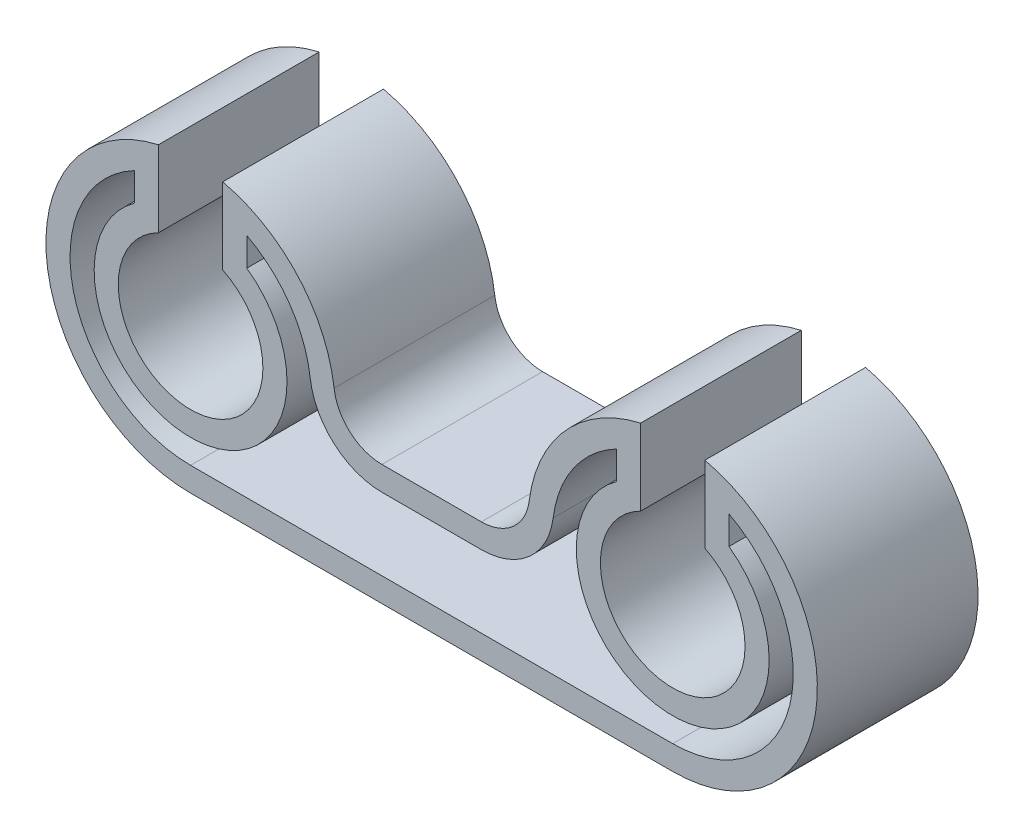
ISO-10303-21;
HEADER;
FILE_DESCRIPTION(('STEP AP214'),'2;1');
FILE_NAME('part.step','',(''),(''),'','','');
FILE_SCHEMA(('AUTOMOTIVE_DESIGN { 1 0 10303 214 1 1 1 1 }'));
ENDSEC;
DATA;
#1=APPLICATION_CONTEXT('core data for automotive mechanical design processes');
#2=APPLICATION_PROTOCOL_DEFINITION('international standard','automotive_design',2000,#1);
#3=PRODUCT_CONTEXT('',#1,'mechanical');
#4=PRODUCT('Part','Part','',(#3));
#5=PRODUCT_RELATED_PRODUCT_CATEGORY('part','',(#4));
#6=PRODUCT_DEFINITION_FORMATION('','',#4);
#7=PRODUCT_DEFINITION_CONTEXT('part definition',#1,'design');
#8=PRODUCT_DEFINITION('design','',#6,#7);
#9=PRODUCT_DEFINITION_SHAPE('','',#8);
#10=(LENGTH_UNIT() NAMED_UNIT(*) SI_UNIT(.MILLI.,.METRE.));
#11=(NAMED_UNIT(*) PLANE_ANGLE_UNIT() SI_UNIT($,.RADIAN.));
#12=(NAMED_UNIT(*) SI_UNIT($,.STERADIAN.) SOLID_ANGLE_UNIT());
#13=UNCERTAINTY_MEASURE_WITH_UNIT(LENGTH_MEASURE(1.E-05),#10,'distance_accuracy_value','');
#14=(GEOMETRIC_REPRESENTATION_CONTEXT(3) GLOBAL_UNCERTAINTY_ASSIGNED_CONTEXT((#13)) GLOBAL_UNIT_ASSIGNED_CONTEXT((#10,
#11,#12)) REPRESENTATION_CONTEXT('',''));
#15=CARTESIAN_POINT('',(0.,0.,0.));
#16=DIRECTION('',(0.,0.,1.));
#17=DIRECTION('',(1.,0.,0.));
#18=AXIS2_PLACEMENT_3D('',#15,#16,#17);
#19=CARTESIAN_POINT('',(30.,0.,10.));
#20=DIRECTION('',(0.,0.,1.));
#21=DIRECTION('',(1.,0.,0.));
#22=AXIS2_PLACEMENT_3D('',#19,#20,#21);
#23=PLANE('',#22);
#24=CARTESIAN_POINT('',(30.,0.,10.));
#25=DIRECTION('',(0.,0.,1.));
#26=DIRECTION('',(1.,0.,0.));
#27=AXIS2_PLACEMENT_3D('',#24,#25,#26);
#28=CIRCLE('',#27,18.);
#29=CARTESIAN_POINT('',(26.,17.5499287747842,10.));
#30=VERTEX_POINT('',#29);
#31=CARTESIAN_POINT('',(12.141178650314,2.25,10.));
#32=VERTEX_POINT('',#31);
#33=EDGE_CURVE('E410',#30,#32,#28,.T.);
#34=ORIENTED_EDGE('',*,*,#33,.T.);
#35=CARTESIAN_POINT('',(6.18823820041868,3.,10.));
#36=DIRECTION('',(0.,0.,-1.));
#37=DIRECTION('',(-1.,0.,0.));
#38=AXIS2_PLACEMENT_3D('',#35,#36,#37);
#39=CIRCLE('',#38,6.);
#40=CARTESIAN_POINT('',(6.18823820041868,-3.,10.));
#41=VERTEX_POINT('',#40);
#42=EDGE_CURVE('E413',#32,#41,#39,.T.);
#43=ORIENTED_EDGE('',*,*,#42,.T.);
#44=DIRECTION('',(-1.,0.,0.));
#45=VECTOR('',#44,1.);
#46=CARTESIAN_POINT('',(-6.18823820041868,-3.,10.));
#47=LINE('',#46,#45);
#48=CARTESIAN_POINT('',(-6.18823820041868,-3.,10.));
#49=VERTEX_POINT('',#48);
#50=EDGE_CURVE('E416',#41,#49,#47,.T.);
#51=ORIENTED_EDGE('',*,*,#50,.T.);
#52=CARTESIAN_POINT('',(-6.18823820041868,3.,10.));
#53=DIRECTION('',(0.,0.,-1.));
#54=DIRECTION('',(-1.,0.,0.));
#55=AXIS2_PLACEMENT_3D('',#52,#53,#54);
#56=CIRCLE('',#55,6.);
#57=CARTESIAN_POINT('',(-12.141178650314,2.25,10.));
#58=VERTEX_POINT('',#57);
#59=EDGE_CURVE('E418',#49,#58,#56,.T.);
#60=ORIENTED_EDGE('',*,*,#59,.T.);
#61=CARTESIAN_POINT('',(-30.,0.,10.));
#62=DIRECTION('',(0.,0.,1.));
#63=DIRECTION('',(1.,0.,0.));
#64=AXIS2_PLACEMENT_3D('',#61,#62,#63);
#65=CIRCLE('',#64,18.);
#66=CARTESIAN_POINT('',(-26.,17.5499287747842,10.));
#67=VERTEX_POINT('',#66);
#68=EDGE_CURVE('E420',#58,#67,#65,.T.);
#69=ORIENTED_EDGE('',*,*,#68,.T.);
#70=DIRECTION('',(0.,-1.,0.));
#71=VECTOR('',#70,1.);
#72=CARTESIAN_POINT('',(-26.,17.5499287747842,10.));
#73=LINE('',#72,#71);
#74=CARTESIAN_POINT('',(-26.,8.06225774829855,10.));
#75=VERTEX_POINT('',#74);
#76=EDGE_CURVE('E422',#67,#75,#73,.T.);
#77=ORIENTED_EDGE('',*,*,#76,.T.);
#78=CARTESIAN_POINT('',(-30.,0.,10.));
#79=DIRECTION('',(0.,0.,-1.));
#80=DIRECTION('',(1.,0.,0.));
#81=AXIS2_PLACEMENT_3D('',#78,#79,#80);
#82=CIRCLE('',#81,9.);
#83=CARTESIAN_POINT('',(-34.,8.06225774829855,10.));
#84=VERTEX_POINT('',#83);
#85=EDGE_CURVE('E424',#75,#84,#82,.T.);
#86=ORIENTED_EDGE('',*,*,#85,.T.);
#87=DIRECTION('',(0.,1.,0.));
#88=VECTOR('',#87,1.);
#89=CARTESIAN_POINT('',(-34.,17.5499287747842,10.));
#90=LINE('',#89,#88);
#91=CARTESIAN_POINT('',(-34.,17.5499287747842,10.));
#92=VERTEX_POINT('',#91);
#93=EDGE_CURVE('E426',#84,#92,#90,.T.);
#94=ORIENTED_EDGE('',*,*,#93,.T.);
#95=CARTESIAN_POINT('',(-30.,0.,10.));
#96=DIRECTION('',(0.,0.,1.));
#97=DIRECTION('',(1.,0.,0.));
#98=AXIS2_PLACEMENT_3D('',#95,#96,#97);
#99=CIRCLE('',#98,18.);
#100=CARTESIAN_POINT('',(-30.,-18.,10.));
#101=VERTEX_POINT('',#100);
#102=EDGE_CURVE('E428',#92,#101,#99,.T.);
#103=ORIENTED_EDGE('',*,*,#102,.T.);
#104=DIRECTION('',(1.,0.,0.));
#105=VECTOR('',#104,1.);
#106=CARTESIAN_POINT('',(-30.,-18.,10.));
#107=LINE('',#106,#105);
#108=CARTESIAN_POINT('',(30.,-18.,10.));
#109=VERTEX_POINT('',#108);
#110=EDGE_CURVE('E430',#101,#109,#107,.T.);
#111=ORIENTED_EDGE('',*,*,#110,.T.);
#112=CARTESIAN_POINT('',(30.,0.,10.));
#113=DIRECTION('',(0.,0.,1.));
#114=DIRECTION('',(1.,0.,0.));
#115=AXIS2_PLACEMENT_3D('',#112,#113,#114);
#116=CIRCLE('',#115,18.);
#117=CARTESIAN_POINT('',(34.,17.5499287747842,10.));
#118=VERTEX_POINT('',#117);
#119=EDGE_CURVE('E432',#109,#118,#116,.T.);
#120=ORIENTED_EDGE('',*,*,#119,.T.);
#121=DIRECTION('',(0.,-1.,0.));
#122=VECTOR('',#121,1.);
#123=CARTESIAN_POINT('',(34.,17.5499287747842,10.));
#124=LINE('',#123,#122);
#125=CARTESIAN_POINT('',(34.,8.06225774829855,10.));
#126=VERTEX_POINT('',#125);
#127=EDGE_CURVE('E434',#118,#126,#124,.T.);
#128=ORIENTED_EDGE('',*,*,#127,.T.);
#129=CARTESIAN_POINT('',(30.,0.,10.));
#130=DIRECTION('',(0.,0.,-1.));
#131=DIRECTION('',(1.,0.,0.));
#132=AXIS2_PLACEMENT_3D('',#129,#130,#131);
#133=CIRCLE('',#132,9.);
#134=CARTESIAN_POINT('',(26.,8.06225774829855,10.));
#135=VERTEX_POINT('',#134);
#136=EDGE_CURVE('E436',#126,#135,#133,.T.);
#137=ORIENTED_EDGE('',*,*,#136,.T.);
#138=DIRECTION('',(0.,1.,0.));
#139=VECTOR('',#138,1.);
#140=CARTESIAN_POINT('',(26.,17.5499287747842,10.));
#141=LINE('',#140,#139);
#142=EDGE_CURVE('E438',#135,#30,#141,.T.);
#143=ORIENTED_EDGE('',*,*,#142,.T.);
#144=EDGE_LOOP('',(#34,#43,#51,#60,#69,#77,#86,#94,#103,#111,#120,#128,#137,#143));
#145=FACE_BOUND('',#144,.T.);
#146=CARTESIAN_POINT('',(6.18823820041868,3.,10.));
#147=DIRECTION('',(0.,0.,1.));
#148=DIRECTION('',(1.,0.,0.));
#149=AXIS2_PLACEMENT_3D('',#146,#147,#148);
#150=CIRCLE('',#149,9.);
#151=CARTESIAN_POINT('',(15.1176488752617,1.87500000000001,10.));
#152=VERTEX_POINT('',#151);
#153=CARTESIAN_POINT('',(6.18823820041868,-6.,10.));
#154=VERTEX_POINT('',#153);
#155=EDGE_CURVE('E311',#152,#154,#150,.F.);
#156=ORIENTED_EDGE('',*,*,#155,.F.);
#157=CARTESIAN_POINT('',(30.,0.,10.));
#158=DIRECTION('',(0.,0.,1.));
#159=DIRECTION('',(1.,0.,0.));
#160=AXIS2_PLACEMENT_3D('',#157,#158,#159);
#161=CIRCLE('',#160,15.);
#162=CARTESIAN_POINT('',(23.,13.2664991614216,10.));
#163=VERTEX_POINT('',#162);
#164=EDGE_CURVE('E303',#163,#152,#161,.T.);
#165=ORIENTED_EDGE('',*,*,#164,.F.);
#166=DIRECTION('',(0.,1.,0.));
#167=VECTOR('',#166,1.);
#168=CARTESIAN_POINT('',(23.,17.5499287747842,10.));
#169=LINE('',#168,#167);
#170=CARTESIAN_POINT('',(23.,9.74679434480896,10.));
#171=VERTEX_POINT('',#170);
#172=EDGE_CURVE('E348',#171,#163,#169,.T.);
#173=ORIENTED_EDGE('',*,*,#172,.F.);
#174=CARTESIAN_POINT('',(30.,0.,10.));
#175=DIRECTION('',(0.,0.,1.));
#176=DIRECTION('',(1.,0.,0.));
#177=AXIS2_PLACEMENT_3D('',#174,#175,#176);
#178=CIRCLE('',#177,12.);
#179=CARTESIAN_POINT('',(37.,9.74679434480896,10.));
#180=VERTEX_POINT('',#179);
#181=EDGE_CURVE('E346',#180,#171,#178,.F.);
#182=ORIENTED_EDGE('',*,*,#181,.F.);
#183=DIRECTION('',(0.,-1.,0.));
#184=VECTOR('',#183,1.);
#185=CARTESIAN_POINT('',(37.,17.5499287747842,10.));
#186=LINE('',#185,#184);
#187=CARTESIAN_POINT('',(37.,13.2664991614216,10.));
#188=VERTEX_POINT('',#187);
#189=EDGE_CURVE('E344',#188,#180,#186,.T.);
#190=ORIENTED_EDGE('',*,*,#189,.F.);
#191=CARTESIAN_POINT('',(30.,0.,10.));
#192=DIRECTION('',(0.,0.,1.));
#193=DIRECTION('',(1.,0.,0.));
#194=AXIS2_PLACEMENT_3D('',#191,#192,#193);
#195=CIRCLE('',#194,15.);
#196=CARTESIAN_POINT('',(30.,-15.,10.));
#197=VERTEX_POINT('',#196);
#198=EDGE_CURVE('E342',#197,#188,#195,.T.);
#199=ORIENTED_EDGE('',*,*,#198,.F.);
#200=DIRECTION('',(1.,0.,0.));
#201=VECTOR('',#200,1.);
#202=CARTESIAN_POINT('',(-30.,-15.,10.));
#203=LINE('',#202,#201);
#204=CARTESIAN_POINT('',(-30.,-15.,10.));
#205=VERTEX_POINT('',#204);
#206=EDGE_CURVE('E340',#205,#197,#203,.T.);
#207=ORIENTED_EDGE('',*,*,#206,.F.);
#208=CARTESIAN_POINT('',(-30.,0.,10.));
#209=DIRECTION('',(0.,0.,1.));
#210=DIRECTION('',(1.,0.,0.));
#211=AXIS2_PLACEMENT_3D('',#208,#209,#210);
#212=CIRCLE('',#211,15.);
#213=CARTESIAN_POINT('',(-37.,13.2664991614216,10.));
#214=VERTEX_POINT('',#213);
#215=EDGE_CURVE('E338',#214,#205,#212,.T.);
#216=ORIENTED_EDGE('',*,*,#215,.F.);
#217=DIRECTION('',(0.,1.,0.));
#218=VECTOR('',#217,1.);
#219=CARTESIAN_POINT('',(-37.,17.5499287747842,10.));
#220=LINE('',#219,#218);
#221=CARTESIAN_POINT('',(-37.,9.74679434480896,10.));
#222=VERTEX_POINT('',#221);
#223=EDGE_CURVE('E336',#222,#214,#220,.T.);
#224=ORIENTED_EDGE('',*,*,#223,.F.);
#225=CARTESIAN_POINT('',(-30.,0.,10.));
#226=DIRECTION('',(0.,0.,1.));
#227=DIRECTION('',(1.,0.,0.));
#228=AXIS2_PLACEMENT_3D('',#225,#226,#227);
#229=CIRCLE('',#228,12.);
#230=CARTESIAN_POINT('',(-23.,9.74679434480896,10.));
#231=VERTEX_POINT('',#230);
#232=EDGE_CURVE('E334',#231,#222,#229,.F.);
#233=ORIENTED_EDGE('',*,*,#232,.F.);
#234=DIRECTION('',(0.,-1.,0.));
#235=VECTOR('',#234,1.);
#236=CARTESIAN_POINT('',(-23.,17.5499287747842,10.));
#237=LINE('',#236,#235);
#238=CARTESIAN_POINT('',(-23.,13.2664991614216,10.));
#239=VERTEX_POINT('',#238);
#240=EDGE_CURVE('E332',#239,#231,#237,.T.);
#241=ORIENTED_EDGE('',*,*,#240,.F.);
#242=CARTESIAN_POINT('',(-30.,0.,10.));
#243=DIRECTION('',(0.,0.,1.));
#244=DIRECTION('',(1.,0.,0.));
#245=AXIS2_PLACEMENT_3D('',#242,#243,#244);
#246=CIRCLE('',#245,15.);
#247=CARTESIAN_POINT('',(-15.1176488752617,1.875,10.));
#248=VERTEX_POINT('',#247);
#249=EDGE_CURVE('E330',#248,#239,#246,.T.);
#250=ORIENTED_EDGE('',*,*,#249,.F.);
#251=CARTESIAN_POINT('',(-6.18823820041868,3.,10.));
#252=DIRECTION('',(0.,0.,1.));
#253=DIRECTION('',(1.,0.,0.));
#254=AXIS2_PLACEMENT_3D('',#251,#252,#253);
#255=CIRCLE('',#254,9.);
#256=CARTESIAN_POINT('',(-6.18823820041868,-6.,10.));
#257=VERTEX_POINT('',#256);
#258=EDGE_CURVE('E326',#257,#248,#255,.F.);
#259=ORIENTED_EDGE('',*,*,#258,.F.);
#260=DIRECTION('',(-1.,0.,0.));
#261=VECTOR('',#260,1.);
#262=CARTESIAN_POINT('',(-6.18823820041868,-6.,10.));
#263=LINE('',#262,#261);
#264=EDGE_CURVE('E324',#154,#257,#263,.T.);
#265=ORIENTED_EDGE('',*,*,#264,.F.);
#266=EDGE_LOOP('',(#156,#165,#173,#182,#190,#199,#207,#216,#224,#233,#241,#250,#259,#265));
#267=FACE_BOUND('',#266,.T.);
#268=ADVANCED_FACE('F118',(#145,#267),#23,.T.);
#269=CARTESIAN_POINT('',(30.,0.,-10.));
#270=DIRECTION('',(0.,0.,1.));
#271=DIRECTION('',(1.,0.,0.));
#272=AXIS2_PLACEMENT_3D('',#269,#270,#271);
#273=PLANE('',#272);
#274=CARTESIAN_POINT('',(30.,0.,-10.));
#275=DIRECTION('',(0.,0.,1.));
#276=DIRECTION('',(1.,0.,0.));
#277=AXIS2_PLACEMENT_3D('',#274,#275,#276);
#278=CIRCLE('',#277,18.);
#279=CARTESIAN_POINT('',(26.,17.5499287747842,-10.));
#280=VERTEX_POINT('',#279);
#281=CARTESIAN_POINT('',(12.141178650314,2.25,-10.));
#282=VERTEX_POINT('',#281);
#283=EDGE_CURVE('E319',#280,#282,#278,.T.);
#284=ORIENTED_EDGE('',*,*,#283,.F.);
#285=DIRECTION('',(0.,1.,0.));
#286=VECTOR('',#285,1.);
#287=CARTESIAN_POINT('',(26.,17.5499287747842,-10.));
#288=LINE('',#287,#286);
#289=CARTESIAN_POINT('',(26.,8.06225774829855,-10.));
#290=VERTEX_POINT('',#289);
#291=EDGE_CURVE('E414',#290,#280,#288,.T.);
#292=ORIENTED_EDGE('',*,*,#291,.F.);
#293=CARTESIAN_POINT('',(30.,0.,-10.));
#294=DIRECTION('',(0.,0.,-1.));
#295=DIRECTION('',(1.,0.,0.));
#296=AXIS2_PLACEMENT_3D('',#293,#294,#295);
#297=CIRCLE('',#296,9.);
#298=CARTESIAN_POINT('',(34.,8.06225774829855,-10.));
#299=VERTEX_POINT('',#298);
#300=EDGE_CURVE('E465',#299,#290,#297,.T.);
#301=ORIENTED_EDGE('',*,*,#300,.F.);
#302=DIRECTION('',(0.,-1.,0.));
#303=VECTOR('',#302,1.);
#304=CARTESIAN_POINT('',(34.,17.5499287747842,-10.));
#305=LINE('',#304,#303);
#306=CARTESIAN_POINT('',(34.,17.5499287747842,-10.));
#307=VERTEX_POINT('',#306);
#308=EDGE_CURVE('E463',#307,#299,#305,.T.);
#309=ORIENTED_EDGE('',*,*,#308,.F.);
#310=CARTESIAN_POINT('',(30.,0.,-10.));
#311=DIRECTION('',(0.,0.,1.));
#312=DIRECTION('',(1.,0.,0.));
#313=AXIS2_PLACEMENT_3D('',#310,#311,#312);
#314=CIRCLE('',#313,18.);
#315=CARTESIAN_POINT('',(30.,-18.,-10.));
#316=VERTEX_POINT('',#315);
#317=EDGE_CURVE('E461',#316,#307,#314,.T.);
#318=ORIENTED_EDGE('',*,*,#317,.F.);
#319=DIRECTION('',(1.,0.,0.));
#320=VECTOR('',#319,1.);
#321=CARTESIAN_POINT('',(-30.,-18.,-10.));
#322=LINE('',#321,#320);
#323=CARTESIAN_POINT('',(-30.,-18.,-10.));
#324=VERTEX_POINT('',#323);
#325=EDGE_CURVE('E459',#324,#316,#322,.T.);
#326=ORIENTED_EDGE('',*,*,#325,.F.);
#327=CARTESIAN_POINT('',(-30.,0.,-10.));
#328=DIRECTION('',(0.,0.,1.));
#329=DIRECTION('',(1.,0.,0.));
#330=AXIS2_PLACEMENT_3D('',#327,#328,#329);
#331=CIRCLE('',#330,18.);
#332=CARTESIAN_POINT('',(-34.,17.5499287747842,-10.));
#333=VERTEX_POINT('',#332);
#334=EDGE_CURVE('E457',#333,#324,#331,.T.);
#335=ORIENTED_EDGE('',*,*,#334,.F.);
#336=DIRECTION('',(0.,1.,0.));
#337=VECTOR('',#336,1.);
#338=CARTESIAN_POINT('',(-34.,17.5499287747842,-10.));
#339=LINE('',#338,#337);
#340=CARTESIAN_POINT('',(-34.,8.06225774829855,-10.));
#341=VERTEX_POINT('',#340);
#342=EDGE_CURVE('E455',#341,#333,#339,.T.);
#343=ORIENTED_EDGE('',*,*,#342,.F.);
#344=CARTESIAN_POINT('',(-30.,0.,-10.));
#345=DIRECTION('',(0.,0.,-1.));
#346=DIRECTION('',(1.,0.,0.));
#347=AXIS2_PLACEMENT_3D('',#344,#345,#346);
#348=CIRCLE('',#347,9.);
#349=CARTESIAN_POINT('',(-26.,8.06225774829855,-10.));
#350=VERTEX_POINT('',#349);
#351=EDGE_CURVE('E453',#350,#341,#348,.T.);
#352=ORIENTED_EDGE('',*,*,#351,.F.);
#353=DIRECTION('',(0.,-1.,0.));
#354=VECTOR('',#353,1.);
#355=CARTESIAN_POINT('',(-26.,17.5499287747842,-10.));
#356=LINE('',#355,#354);
#357=CARTESIAN_POINT('',(-26.,17.5499287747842,-10.));
#358=VERTEX_POINT('',#357);
#359=EDGE_CURVE('E451',#358,#350,#356,.T.);
#360=ORIENTED_EDGE('',*,*,#359,.F.);
#361=CARTESIAN_POINT('',(-30.,0.,-10.));
#362=DIRECTION('',(0.,0.,1.));
#363=DIRECTION('',(1.,0.,0.));
#364=AXIS2_PLACEMENT_3D('',#361,#362,#363);
#365=CIRCLE('',#364,18.);
#366=CARTESIAN_POINT('',(-12.141178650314,2.25,-10.));
#367=VERTEX_POINT('',#366);
#368=EDGE_CURVE('E449',#367,#358,#365,.T.);
#369=ORIENTED_EDGE('',*,*,#368,.F.);
#370=CARTESIAN_POINT('',(-6.18823820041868,3.,-10.));
#371=DIRECTION('',(0.,0.,-1.));
#372=DIRECTION('',(-1.,0.,0.));
#373=AXIS2_PLACEMENT_3D('',#370,#371,#372);
#374=CIRCLE('',#373,6.);
#375=CARTESIAN_POINT('',(-6.18823820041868,-3.,-10.));
#376=VERTEX_POINT('',#375);
#377=EDGE_CURVE('E447',#376,#367,#374,.T.);
#378=ORIENTED_EDGE('',*,*,#377,.F.);
#379=DIRECTION('',(-1.,0.,0.));
#380=VECTOR('',#379,1.);
#381=CARTESIAN_POINT('',(-6.18823820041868,-3.,-10.));
#382=LINE('',#381,#380);
#383=CARTESIAN_POINT('',(6.18823820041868,-3.,-10.));
#384=VERTEX_POINT('',#383);
#385=EDGE_CURVE('E445',#384,#376,#382,.T.);
#386=ORIENTED_EDGE('',*,*,#385,.F.);
#387=CARTESIAN_POINT('',(6.18823820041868,3.,-10.));
#388=DIRECTION('',(0.,0.,-1.));
#389=DIRECTION('',(-1.,0.,0.));
#390=AXIS2_PLACEMENT_3D('',#387,#388,#389);
#391=CIRCLE('',#390,6.);
#392=EDGE_CURVE('E443',#282,#384,#391,.T.);
#393=ORIENTED_EDGE('',*,*,#392,.F.);
#394=EDGE_LOOP('',(#284,#292,#301,#309,#318,#326,#335,#343,#352,#360,#369,#378,#386,#393));
#395=FACE_BOUND('',#394,.T.);
#396=CARTESIAN_POINT('',(30.,0.,-10.));
#397=DIRECTION('',(0.,0.,1.));
#398=DIRECTION('',(1.,0.,0.));
#399=AXIS2_PLACEMENT_3D('',#396,#397,#398);
#400=CIRCLE('',#399,15.);
#401=CARTESIAN_POINT('',(23.,13.2664991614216,-10.));
#402=VERTEX_POINT('',#401);
#403=CARTESIAN_POINT('',(15.1176488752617,1.87500000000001,-10.));
#404=VERTEX_POINT('',#403);
#405=EDGE_CURVE('E141',#402,#404,#400,.T.);
#406=ORIENTED_EDGE('',*,*,#405,.T.);
#407=CARTESIAN_POINT('',(6.18823820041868,3.,-10.));
#408=DIRECTION('',(0.,0.,1.));
#409=DIRECTION('',(1.,0.,0.));
#410=AXIS2_PLACEMENT_3D('',#407,#408,#409);
#411=CIRCLE('',#410,9.);
#412=CARTESIAN_POINT('',(6.18823820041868,-6.,-10.));
#413=VERTEX_POINT('',#412);
#414=EDGE_CURVE('E318',#404,#413,#411,.F.);
#415=ORIENTED_EDGE('',*,*,#414,.T.);
#416=DIRECTION('',(-1.,0.,0.));
#417=VECTOR('',#416,1.);
#418=CARTESIAN_POINT('',(-6.18823820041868,-6.,-10.));
#419=LINE('',#418,#417);
#420=CARTESIAN_POINT('',(-6.18823820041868,-6.,-10.));
#421=VERTEX_POINT('',#420);
#422=EDGE_CURVE('E352',#413,#421,#419,.T.);
#423=ORIENTED_EDGE('',*,*,#422,.T.);
#424=CARTESIAN_POINT('',(-6.18823820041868,3.,-10.));
#425=DIRECTION('',(0.,0.,1.));
#426=DIRECTION('',(1.,0.,0.));
#427=AXIS2_PLACEMENT_3D('',#424,#425,#426);
#428=CIRCLE('',#427,9.);
#429=CARTESIAN_POINT('',(-15.1176488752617,1.875,-10.));
#430=VERTEX_POINT('',#429);
#431=EDGE_CURVE('E355',#421,#430,#428,.F.);
#432=ORIENTED_EDGE('',*,*,#431,.T.);
#433=CARTESIAN_POINT('',(-30.,0.,-10.));
#434=DIRECTION('',(0.,0.,1.));
#435=DIRECTION('',(1.,0.,0.));
#436=AXIS2_PLACEMENT_3D('',#433,#434,#435);
#437=CIRCLE('',#436,15.);
#438=CARTESIAN_POINT('',(-23.,13.2664991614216,-10.));
#439=VERTEX_POINT('',#438);
#440=EDGE_CURVE('E358',#430,#439,#437,.T.);
#441=ORIENTED_EDGE('',*,*,#440,.T.);
#442=DIRECTION('',(0.,-1.,0.));
#443=VECTOR('',#442,1.);
#444=CARTESIAN_POINT('',(-23.,17.5499287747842,-10.));
#445=LINE('',#444,#443);
#446=CARTESIAN_POINT('',(-23.,9.74679434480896,-10.));
#447=VERTEX_POINT('',#446);
#448=EDGE_CURVE('E361',#439,#447,#445,.T.);
#449=ORIENTED_EDGE('',*,*,#448,.T.);
#450=CARTESIAN_POINT('',(-30.,0.,-10.));
#451=DIRECTION('',(0.,0.,1.));
#452=DIRECTION('',(1.,0.,0.));
#453=AXIS2_PLACEMENT_3D('',#450,#451,#452);
#454=CIRCLE('',#453,12.);
#455=CARTESIAN_POINT('',(-37.,9.74679434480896,-10.));
#456=VERTEX_POINT('',#455);
#457=EDGE_CURVE('E364',#447,#456,#454,.F.);
#458=ORIENTED_EDGE('',*,*,#457,.T.);
#459=DIRECTION('',(0.,1.,0.));
#460=VECTOR('',#459,1.);
#461=CARTESIAN_POINT('',(-37.,17.5499287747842,-10.));
#462=LINE('',#461,#460);
#463=CARTESIAN_POINT('',(-37.,13.2664991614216,-10.));
#464=VERTEX_POINT('',#463);
#465=EDGE_CURVE('E367',#456,#464,#462,.T.);
#466=ORIENTED_EDGE('',*,*,#465,.T.);
#467=CARTESIAN_POINT('',(-30.,0.,-10.));
#468=DIRECTION('',(0.,0.,1.));
#469=DIRECTION('',(1.,0.,0.));
#470=AXIS2_PLACEMENT_3D('',#467,#468,#469);
#471=CIRCLE('',#470,15.);
#472=CARTESIAN_POINT('',(-30.,-15.,-10.));
#473=VERTEX_POINT('',#472);
#474=EDGE_CURVE('E370',#464,#473,#471,.T.);
#475=ORIENTED_EDGE('',*,*,#474,.T.);
#476=DIRECTION('',(1.,0.,0.));
#477=VECTOR('',#476,1.);
#478=CARTESIAN_POINT('',(-30.,-15.,-10.));
#479=LINE('',#478,#477);
#480=CARTESIAN_POINT('',(30.,-15.,-10.));
#481=VERTEX_POINT('',#480);
#482=EDGE_CURVE('E373',#473,#481,#479,.T.);
#483=ORIENTED_EDGE('',*,*,#482,.T.);
#484=CARTESIAN_POINT('',(30.,0.,-10.));
#485=DIRECTION('',(0.,0.,1.));
#486=DIRECTION('',(1.,0.,0.));
#487=AXIS2_PLACEMENT_3D('',#484,#485,#486);
#488=CIRCLE('',#487,15.);
#489=CARTESIAN_POINT('',(37.,13.2664991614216,-10.));
#490=VERTEX_POINT('',#489);
#491=EDGE_CURVE('E376',#481,#490,#488,.T.);
#492=ORIENTED_EDGE('',*,*,#491,.T.);
#493=DIRECTION('',(0.,-1.,0.));
#494=VECTOR('',#493,1.);
#495=CARTESIAN_POINT('',(37.,17.5499287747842,-10.));
#496=LINE('',#495,#494);
#497=CARTESIAN_POINT('',(37.,9.74679434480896,-10.));
#498=VERTEX_POINT('',#497);
#499=EDGE_CURVE('E379',#490,#498,#496,.T.);
#500=ORIENTED_EDGE('',*,*,#499,.T.);
#501=CARTESIAN_POINT('',(30.,0.,-10.));
#502=DIRECTION('',(0.,0.,1.));
#503=DIRECTION('',(1.,0.,0.));
#504=AXIS2_PLACEMENT_3D('',#501,#502,#503);
#505=CIRCLE('',#504,12.);
#506=CARTESIAN_POINT('',(23.,9.74679434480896,-10.));
#507=VERTEX_POINT('',#506);
#508=EDGE_CURVE('E382',#498,#507,#505,.F.);
#509=ORIENTED_EDGE('',*,*,#508,.T.);
#510=DIRECTION('',(0.,1.,0.));
#511=VECTOR('',#510,1.);
#512=CARTESIAN_POINT('',(23.,17.5499287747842,-10.));
#513=LINE('',#512,#511);
#514=EDGE_CURVE('E312',#507,#402,#513,.T.);
#515=ORIENTED_EDGE('',*,*,#514,.T.);
#516=EDGE_LOOP('',(#406,#415,#423,#432,#441,#449,#458,#466,#475,#483,#492,#500,#509,#515));
#517=FACE_BOUND('',#516,.T.);
#518=ADVANCED_FACE('F513',(#395,#517),#273,.F.);
#519=CARTESIAN_POINT('',(30.,0.,10.));
#520=DIRECTION('',(0.,0.,-1.));
#521=DIRECTION('',(-1.,0.,0.));
#522=AXIS2_PLACEMENT_3D('',#519,#520,#521);
#523=CYLINDRICAL_SURFACE('',#522,18.);
#524=ORIENTED_EDGE('',*,*,#283,.T.);
#525=DIRECTION('',(0.,0.,-1.));
#526=VECTOR('',#525,1.);
#527=CARTESIAN_POINT('',(12.141178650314,2.25,10.));
#528=LINE('',#527,#526);
#529=EDGE_CURVE('E12',#32,#282,#528,.T.);
#530=ORIENTED_EDGE('',*,*,#529,.F.);
#531=ORIENTED_EDGE('',*,*,#33,.F.);
#532=DIRECTION('',(0.,0.,-1.));
#533=VECTOR('',#532,1.);
#534=CARTESIAN_POINT('',(26.,17.5499287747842,10.));
#535=LINE('',#534,#533);
#536=EDGE_CURVE('E440',#30,#280,#535,.T.);
#537=ORIENTED_EDGE('',*,*,#536,.T.);
#538=EDGE_LOOP('',(#524,#530,#531,#537));
#539=FACE_BOUND('',#538,.T.);
#540=ADVANCED_FACE('F120',(#539),#523,.T.);
#541=CARTESIAN_POINT('',(6.18823820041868,3.,10.));
#542=DIRECTION('',(0.,0.,-1.));
#543=DIRECTION('',(-1.,0.,0.));
#544=AXIS2_PLACEMENT_3D('',#541,#542,#543);
#545=CYLINDRICAL_SURFACE('',#544,6.);
#546=ORIENTED_EDGE('',*,*,#392,.T.);
#547=DIRECTION('',(0.,0.,-1.));
#548=VECTOR('',#547,1.);
#549=CARTESIAN_POINT('',(6.18823820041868,-3.,10.));
#550=LINE('',#549,#548);
#551=EDGE_CURVE('E126',#41,#384,#550,.T.);
#552=ORIENTED_EDGE('',*,*,#551,.F.);
#553=ORIENTED_EDGE('',*,*,#42,.F.);
#554=ORIENTED_EDGE('',*,*,#529,.T.);
#555=EDGE_LOOP('',(#546,#552,#553,#554));
#556=FACE_BOUND('',#555,.T.);
#557=ADVANCED_FACE('F530',(#556),#545,.F.);
#558=CARTESIAN_POINT('',(-6.18823820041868,-3.,10.));
#559=DIRECTION('',(0.,-1.,0.));
#560=DIRECTION('',(0.,0.,-1.));
#561=AXIS2_PLACEMENT_3D('',#558,#559,#560);
#562=PLANE('',#561);
#563=ORIENTED_EDGE('',*,*,#385,.T.);
#564=DIRECTION('',(0.,0.,-1.));
#565=VECTOR('',#564,1.);
#566=CARTESIAN_POINT('',(-6.18823820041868,-3.,10.));
#567=LINE('',#566,#565);
#568=EDGE_CURVE('E500',#49,#376,#567,.T.);
#569=ORIENTED_EDGE('',*,*,#568,.F.);
#570=ORIENTED_EDGE('',*,*,#50,.F.);
#571=ORIENTED_EDGE('',*,*,#551,.T.);
#572=EDGE_LOOP('',(#563,#569,#570,#571));
#573=FACE_BOUND('',#572,.T.);
#574=ADVANCED_FACE('F507',(#573),#562,.F.);
#575=CARTESIAN_POINT('',(-6.18823820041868,3.,10.));
#576=DIRECTION('',(0.,0.,-1.));
#577=DIRECTION('',(-1.,0.,0.));
#578=AXIS2_PLACEMENT_3D('',#575,#576,#577);
#579=CYLINDRICAL_SURFACE('',#578,6.);
#580=ORIENTED_EDGE('',*,*,#377,.T.);
#581=DIRECTION('',(0.,0.,-1.));
#582=VECTOR('',#581,1.);
#583=CARTESIAN_POINT('',(-12.141178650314,2.25,10.));
#584=LINE('',#583,#582);
#585=EDGE_CURVE('E497',#58,#367,#584,.T.);
#586=ORIENTED_EDGE('',*,*,#585,.F.);
#587=ORIENTED_EDGE('',*,*,#59,.F.);
#588=ORIENTED_EDGE('',*,*,#568,.T.);
#589=EDGE_LOOP('',(#580,#586,#587,#588));
#590=FACE_BOUND('',#589,.T.);
#591=ADVANCED_FACE('F519',(#590),#579,.F.);
#592=CARTESIAN_POINT('',(-30.,0.,10.));
#593=DIRECTION('',(0.,0.,-1.));
#594=DIRECTION('',(-1.,0.,0.));
#595=AXIS2_PLACEMENT_3D('',#592,#593,#594);
#596=CYLINDRICAL_SURFACE('',#595,18.);
#597=ORIENTED_EDGE('',*,*,#368,.T.);
#598=DIRECTION('',(0.,0.,-1.));
#599=VECTOR('',#598,1.);
#600=CARTESIAN_POINT('',(-26.,17.5499287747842,10.));
#601=LINE('',#600,#599);
#602=EDGE_CURVE('E494',#67,#358,#601,.T.);
#603=ORIENTED_EDGE('',*,*,#602,.F.);
#604=ORIENTED_EDGE('',*,*,#68,.F.);
#605=ORIENTED_EDGE('',*,*,#585,.T.);
#606=EDGE_LOOP('',(#597,#603,#604,#605));
#607=FACE_BOUND('',#606,.T.);
#608=ADVANCED_FACE('F523',(#607),#596,.T.);
#609=CARTESIAN_POINT('',(-26.,17.5499287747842,10.));
#610=DIRECTION('',(1.,0.,0.));
#611=DIRECTION('',(0.,1.,0.));
#612=AXIS2_PLACEMENT_3D('',#609,#610,#611);
#613=PLANE('',#612);
#614=ORIENTED_EDGE('',*,*,#359,.T.);
#615=DIRECTION('',(0.,0.,-1.));
#616=VECTOR('',#615,1.);
#617=CARTESIAN_POINT('',(-26.,8.06225774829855,10.));
#618=LINE('',#617,#616);
#619=EDGE_CURVE('E491',#75,#350,#618,.T.);
#620=ORIENTED_EDGE('',*,*,#619,.F.);
#621=ORIENTED_EDGE('',*,*,#76,.F.);
#622=ORIENTED_EDGE('',*,*,#602,.T.);
#623=EDGE_LOOP('',(#614,#620,#621,#622));
#624=FACE_BOUND('',#623,.T.);
#625=ADVANCED_FACE('F573',(#624),#613,.F.);
#626=CARTESIAN_POINT('',(-30.,0.,10.));
#627=DIRECTION('',(0.,0.,-1.));
#628=DIRECTION('',(-1.,0.,0.));
#629=AXIS2_PLACEMENT_3D('',#626,#627,#628);
#630=CYLINDRICAL_SURFACE('',#629,9.);
#631=ORIENTED_EDGE('',*,*,#351,.T.);
#632=DIRECTION('',(0.,0.,-1.));
#633=VECTOR('',#632,1.);
#634=CARTESIAN_POINT('',(-34.,8.06225774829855,10.));
#635=LINE('',#634,#633);
#636=EDGE_CURVE('E488',#84,#341,#635,.T.);
#637=ORIENTED_EDGE('',*,*,#636,.F.);
#638=ORIENTED_EDGE('',*,*,#85,.F.);
#639=ORIENTED_EDGE('',*,*,#619,.T.);
#640=EDGE_LOOP('',(#631,#637,#638,#639));
#641=FACE_BOUND('',#640,.T.);
#642=ADVANCED_FACE('F571',(#641),#630,.F.);
#643=CARTESIAN_POINT('',(-34.,17.5499287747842,10.));
#644=DIRECTION('',(-1.,0.,0.));
#645=DIRECTION('',(0.,-1.,0.));
#646=AXIS2_PLACEMENT_3D('',#643,#644,#645);
#647=PLANE('',#646);
#648=ORIENTED_EDGE('',*,*,#342,.T.);
#649=DIRECTION('',(0.,0.,-1.));
#650=VECTOR('',#649,1.);
#651=CARTESIAN_POINT('',(-34.,17.5499287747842,10.));
#652=LINE('',#651,#650);
#653=EDGE_CURVE('E485',#92,#333,#652,.T.);
#654=ORIENTED_EDGE('',*,*,#653,.F.);
#655=ORIENTED_EDGE('',*,*,#93,.F.);
#656=ORIENTED_EDGE('',*,*,#636,.T.);
#657=EDGE_LOOP('',(#648,#654,#655,#656));
#658=FACE_BOUND('',#657,.T.);
#659=ADVANCED_FACE('F566',(#658),#647,.F.);
#660=CARTESIAN_POINT('',(-30.,0.,10.));
#661=DIRECTION('',(0.,0.,-1.));
#662=DIRECTION('',(-1.,0.,0.));
#663=AXIS2_PLACEMENT_3D('',#660,#661,#662);
#664=CYLINDRICAL_SURFACE('',#663,18.);
#665=ORIENTED_EDGE('',*,*,#334,.T.);
#666=DIRECTION('',(0.,0.,-1.));
#667=VECTOR('',#666,1.);
#668=CARTESIAN_POINT('',(-30.,-18.,10.));
#669=LINE('',#668,#667);
#670=EDGE_CURVE('E482',#101,#324,#669,.T.);
#671=ORIENTED_EDGE('',*,*,#670,.F.);
#672=ORIENTED_EDGE('',*,*,#102,.F.);
#673=ORIENTED_EDGE('',*,*,#653,.T.);
#674=EDGE_LOOP('',(#665,#671,#672,#673));
#675=FACE_BOUND('',#674,.T.);
#676=ADVANCED_FACE('F561',(#675),#664,.T.);
#677=CARTESIAN_POINT('',(-30.,-18.,10.));
#678=DIRECTION('',(0.,1.,0.));
#679=DIRECTION('',(-1.,0.,0.));
#680=AXIS2_PLACEMENT_3D('',#677,#678,#679);
#681=PLANE('',#680);
#682=ORIENTED_EDGE('',*,*,#325,.T.);
#683=DIRECTION('',(0.,0.,-1.));
#684=VECTOR('',#683,1.);
#685=CARTESIAN_POINT('',(30.,-18.,10.));
#686=LINE('',#685,#684);
#687=EDGE_CURVE('E479',#109,#316,#686,.T.);
#688=ORIENTED_EDGE('',*,*,#687,.F.);
#689=ORIENTED_EDGE('',*,*,#110,.F.);
#690=ORIENTED_EDGE('',*,*,#670,.T.);
#691=EDGE_LOOP('',(#682,#688,#689,#690));
#692=FACE_BOUND('',#691,.T.);
#693=ADVANCED_FACE('F557',(#692),#681,.F.);
#694=CARTESIAN_POINT('',(30.,0.,10.));
#695=DIRECTION('',(0.,0.,-1.));
#696=DIRECTION('',(-1.,0.,0.));
#697=AXIS2_PLACEMENT_3D('',#694,#695,#696);
#698=CYLINDRICAL_SURFACE('',#697,18.);
#699=ORIENTED_EDGE('',*,*,#317,.T.);
#700=DIRECTION('',(0.,0.,-1.));
#701=VECTOR('',#700,1.);
#702=CARTESIAN_POINT('',(34.,17.5499287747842,10.));
#703=LINE('',#702,#701);
#704=EDGE_CURVE('E476',#118,#307,#703,.T.);
#705=ORIENTED_EDGE('',*,*,#704,.F.);
#706=ORIENTED_EDGE('',*,*,#119,.F.);
#707=ORIENTED_EDGE('',*,*,#687,.T.);
#708=EDGE_LOOP('',(#699,#705,#706,#707));
#709=FACE_BOUND('',#708,.T.);
#710=ADVANCED_FACE('F552',(#709),#698,.T.);
#711=CARTESIAN_POINT('',(34.,17.5499287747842,10.));
#712=DIRECTION('',(1.,0.,0.));
#713=DIRECTION('',(0.,0.,-1.));
#714=AXIS2_PLACEMENT_3D('',#711,#712,#713);
#715=PLANE('',#714);
#716=ORIENTED_EDGE('',*,*,#308,.T.);
#717=DIRECTION('',(0.,0.,-1.));
#718=VECTOR('',#717,1.);
#719=CARTESIAN_POINT('',(34.,8.06225774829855,10.));
#720=LINE('',#719,#718);
#721=EDGE_CURVE('E473',#126,#299,#720,.T.);
#722=ORIENTED_EDGE('',*,*,#721,.F.);
#723=ORIENTED_EDGE('',*,*,#127,.F.);
#724=ORIENTED_EDGE('',*,*,#704,.T.);
#725=EDGE_LOOP('',(#716,#722,#723,#724));
#726=FACE_BOUND('',#725,.T.);
#727=ADVANCED_FACE('F546',(#726),#715,.F.);
#728=CARTESIAN_POINT('',(30.,0.,10.));
#729=DIRECTION('',(0.,0.,-1.));
#730=DIRECTION('',(-1.,0.,0.));
#731=AXIS2_PLACEMENT_3D('',#728,#729,#730);
#732=CYLINDRICAL_SURFACE('',#731,9.);
#733=ORIENTED_EDGE('',*,*,#300,.T.);
#734=DIRECTION('',(0.,0.,-1.));
#735=VECTOR('',#734,1.);
#736=CARTESIAN_POINT('',(26.,8.06225774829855,10.));
#737=LINE('',#736,#735);
#738=EDGE_CURVE('E470',#135,#290,#737,.T.);
#739=ORIENTED_EDGE('',*,*,#738,.F.);
#740=ORIENTED_EDGE('',*,*,#136,.F.);
#741=ORIENTED_EDGE('',*,*,#721,.T.);
#742=EDGE_LOOP('',(#733,#739,#740,#741));
#743=FACE_BOUND('',#742,.T.);
#744=ADVANCED_FACE('F542',(#743),#732,.F.);
#745=CARTESIAN_POINT('',(26.,17.5499287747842,10.));
#746=DIRECTION('',(-1.,0.,0.));
#747=DIRECTION('',(0.,-1.,0.));
#748=AXIS2_PLACEMENT_3D('',#745,#746,#747);
#749=PLANE('',#748);
#750=ORIENTED_EDGE('',*,*,#291,.T.);
#751=ORIENTED_EDGE('',*,*,#536,.F.);
#752=ORIENTED_EDGE('',*,*,#142,.F.);
#753=ORIENTED_EDGE('',*,*,#738,.T.);
#754=EDGE_LOOP('',(#750,#751,#752,#753));
#755=FACE_BOUND('',#754,.T.);
#756=ADVANCED_FACE('F537',(#755),#749,.F.);
#757=CARTESIAN_POINT('',(30.,0.,10.));
#758=DIRECTION('',(0.,0.,-1.));
#759=DIRECTION('',(-1.,0.,0.));
#760=AXIS2_PLACEMENT_3D('',#757,#758,#759);
#761=CYLINDRICAL_SURFACE('',#760,15.);
#762=ORIENTED_EDGE('',*,*,#405,.F.);
#763=DIRECTION('',(0.,0.,-1.));
#764=VECTOR('',#763,1.);
#765=CARTESIAN_POINT('',(23.,13.2664991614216,10.));
#766=LINE('',#765,#764);
#767=EDGE_CURVE('E307',#163,#402,#766,.T.);
#768=ORIENTED_EDGE('',*,*,#767,.F.);
#769=ORIENTED_EDGE('',*,*,#164,.T.);
#770=DIRECTION('',(0.,0.,-1.));
#771=VECTOR('',#770,1.);
#772=CARTESIAN_POINT('',(15.1176488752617,1.87500000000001,10.));
#773=LINE('',#772,#771);
#774=EDGE_CURVE('E306',#152,#404,#773,.T.);
#775=ORIENTED_EDGE('',*,*,#774,.T.);
#776=EDGE_LOOP('',(#762,#768,#769,#775));
#777=FACE_BOUND('',#776,.T.);
#778=ADVANCED_FACE('F305',(#777),#761,.F.);
#779=CARTESIAN_POINT('',(6.18823820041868,3.,10.));
#780=DIRECTION('',(0.,0.,-1.));
#781=DIRECTION('',(-1.,0.,0.));
#782=AXIS2_PLACEMENT_3D('',#779,#780,#781);
#783=CYLINDRICAL_SURFACE('',#782,9.);
#784=ORIENTED_EDGE('',*,*,#414,.F.);
#785=ORIENTED_EDGE('',*,*,#774,.F.);
#786=ORIENTED_EDGE('',*,*,#155,.T.);
#787=DIRECTION('',(0.,0.,-1.));
#788=VECTOR('',#787,1.);
#789=CARTESIAN_POINT('',(6.18823820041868,-6.,10.));
#790=LINE('',#789,#788);
#791=EDGE_CURVE('E320',#154,#413,#790,.T.);
#792=ORIENTED_EDGE('',*,*,#791,.T.);
#793=EDGE_LOOP('',(#784,#785,#786,#792));
#794=FACE_BOUND('',#793,.T.);
#795=ADVANCED_FACE('F315',(#794),#783,.T.);
#796=CARTESIAN_POINT('',(-6.18823820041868,-6.,10.));
#797=DIRECTION('',(0.,-1.,0.));
#798=DIRECTION('',(0.,0.,-1.));
#799=AXIS2_PLACEMENT_3D('',#796,#797,#798);
#800=PLANE('',#799);
#801=ORIENTED_EDGE('',*,*,#422,.F.);
#802=ORIENTED_EDGE('',*,*,#791,.F.);
#803=ORIENTED_EDGE('',*,*,#264,.T.);
#804=DIRECTION('',(0.,0.,-1.));
#805=VECTOR('',#804,1.);
#806=CARTESIAN_POINT('',(-6.18823820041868,-6.,10.));
#807=LINE('',#806,#805);
#808=EDGE_CURVE('E407',#257,#421,#807,.T.);
#809=ORIENTED_EDGE('',*,*,#808,.T.);
#810=EDGE_LOOP('',(#801,#802,#803,#809));
#811=FACE_BOUND('',#810,.T.);
#812=ADVANCED_FACE('F643',(#811),#800,.T.);
#813=CARTESIAN_POINT('',(-6.18823820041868,3.,10.));
#814=DIRECTION('',(0.,0.,-1.));
#815=DIRECTION('',(-1.,0.,0.));
#816=AXIS2_PLACEMENT_3D('',#813,#814,#815);
#817=CYLINDRICAL_SURFACE('',#816,9.);
#818=ORIENTED_EDGE('',*,*,#431,.F.);
#819=ORIENTED_EDGE('',*,*,#808,.F.);
#820=ORIENTED_EDGE('',*,*,#258,.T.);
#821=DIRECTION('',(0.,0.,-1.));
#822=VECTOR('',#821,1.);
#823=CARTESIAN_POINT('',(-15.1176488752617,1.875,10.));
#824=LINE('',#823,#822);
#825=EDGE_CURVE('E405',#248,#430,#824,.T.);
#826=ORIENTED_EDGE('',*,*,#825,.T.);
#827=EDGE_LOOP('',(#818,#819,#820,#826));
#828=FACE_BOUND('',#827,.T.);
#829=ADVANCED_FACE('F649',(#828),#817,.T.);
#830=CARTESIAN_POINT('',(-30.,0.,10.));
#831=DIRECTION('',(0.,0.,-1.));
#832=DIRECTION('',(-1.,0.,0.));
#833=AXIS2_PLACEMENT_3D('',#830,#831,#832);
#834=CYLINDRICAL_SURFACE('',#833,15.);
#835=ORIENTED_EDGE('',*,*,#440,.F.);
#836=ORIENTED_EDGE('',*,*,#825,.F.);
#837=ORIENTED_EDGE('',*,*,#249,.T.);
#838=DIRECTION('',(0.,0.,-1.));
#839=VECTOR('',#838,1.);
#840=CARTESIAN_POINT('',(-23.,13.2664991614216,10.));
#841=LINE('',#840,#839);
#842=EDGE_CURVE('E403',#239,#439,#841,.T.);
#843=ORIENTED_EDGE('',*,*,#842,.T.);
#844=EDGE_LOOP('',(#835,#836,#837,#843));
#845=FACE_BOUND('',#844,.T.);
#846=ADVANCED_FACE('F657',(#845),#834,.F.);
#847=CARTESIAN_POINT('',(-23.,17.5499287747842,10.));
#848=DIRECTION('',(1.,0.,0.));
#849=DIRECTION('',(0.,1.,0.));
#850=AXIS2_PLACEMENT_3D('',#847,#848,#849);
#851=PLANE('',#850);
#852=ORIENTED_EDGE('',*,*,#448,.F.);
#853=ORIENTED_EDGE('',*,*,#842,.F.);
#854=ORIENTED_EDGE('',*,*,#240,.T.);
#855=DIRECTION('',(0.,0.,-1.));
#856=VECTOR('',#855,1.);
#857=CARTESIAN_POINT('',(-23.,9.74679434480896,10.));
#858=LINE('',#857,#856);
#859=EDGE_CURVE('E401',#231,#447,#858,.T.);
#860=ORIENTED_EDGE('',*,*,#859,.T.);
#861=EDGE_LOOP('',(#852,#853,#854,#860));
#862=FACE_BOUND('',#861,.T.);
#863=ADVANCED_FACE('F665',(#862),#851,.T.);
#864=CARTESIAN_POINT('',(-30.,0.,10.));
#865=DIRECTION('',(0.,0.,-1.));
#866=DIRECTION('',(-1.,0.,0.));
#867=AXIS2_PLACEMENT_3D('',#864,#865,#866);
#868=CYLINDRICAL_SURFACE('',#867,12.);
#869=ORIENTED_EDGE('',*,*,#457,.F.);
#870=ORIENTED_EDGE('',*,*,#859,.F.);
#871=ORIENTED_EDGE('',*,*,#232,.T.);
#872=DIRECTION('',(0.,0.,-1.));
#873=VECTOR('',#872,1.);
#874=CARTESIAN_POINT('',(-37.,9.74679434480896,10.));
#875=LINE('',#874,#873);
#876=EDGE_CURVE('E399',#222,#456,#875,.T.);
#877=ORIENTED_EDGE('',*,*,#876,.T.);
#878=EDGE_LOOP('',(#869,#870,#871,#877));
#879=FACE_BOUND('',#878,.T.);
#880=ADVANCED_FACE('F673',(#879),#868,.T.);
#881=CARTESIAN_POINT('',(-37.,17.5499287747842,10.));
#882=DIRECTION('',(-1.,0.,0.));
#883=DIRECTION('',(0.,-1.,0.));
#884=AXIS2_PLACEMENT_3D('',#881,#882,#883);
#885=PLANE('',#884);
#886=ORIENTED_EDGE('',*,*,#465,.F.);
#887=ORIENTED_EDGE('',*,*,#876,.F.);
#888=ORIENTED_EDGE('',*,*,#223,.T.);
#889=DIRECTION('',(0.,0.,-1.));
#890=VECTOR('',#889,1.);
#891=CARTESIAN_POINT('',(-37.,13.2664991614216,10.));
#892=LINE('',#891,#890);
#893=EDGE_CURVE('E397',#214,#464,#892,.T.);
#894=ORIENTED_EDGE('',*,*,#893,.T.);
#895=EDGE_LOOP('',(#886,#887,#888,#894));
#896=FACE_BOUND('',#895,.T.);
#897=ADVANCED_FACE('F681',(#896),#885,.T.);
#898=CARTESIAN_POINT('',(-30.,0.,10.));
#899=DIRECTION('',(0.,0.,-1.));
#900=DIRECTION('',(-1.,0.,0.));
#901=AXIS2_PLACEMENT_3D('',#898,#899,#900);
#902=CYLINDRICAL_SURFACE('',#901,15.);
#903=ORIENTED_EDGE('',*,*,#474,.F.);
#904=ORIENTED_EDGE('',*,*,#893,.F.);
#905=ORIENTED_EDGE('',*,*,#215,.T.);
#906=DIRECTION('',(0.,0.,-1.));
#907=VECTOR('',#906,1.);
#908=CARTESIAN_POINT('',(-30.,-15.,10.));
#909=LINE('',#908,#907);
#910=EDGE_CURVE('E395',#205,#473,#909,.T.);
#911=ORIENTED_EDGE('',*,*,#910,.T.);
#912=EDGE_LOOP('',(#903,#904,#905,#911));
#913=FACE_BOUND('',#912,.T.);
#914=ADVANCED_FACE('F689',(#913),#902,.F.);
#915=CARTESIAN_POINT('',(-30.,-15.,10.));
#916=DIRECTION('',(0.,1.,0.));
#917=DIRECTION('',(-1.,0.,0.));
#918=AXIS2_PLACEMENT_3D('',#915,#916,#917);
#919=PLANE('',#918);
#920=ORIENTED_EDGE('',*,*,#482,.F.);
#921=ORIENTED_EDGE('',*,*,#910,.F.);
#922=ORIENTED_EDGE('',*,*,#206,.T.);
#923=DIRECTION('',(0.,0.,-1.));
#924=VECTOR('',#923,1.);
#925=CARTESIAN_POINT('',(30.,-15.,10.));
#926=LINE('',#925,#924);
#927=EDGE_CURVE('E393',#197,#481,#926,.T.);
#928=ORIENTED_EDGE('',*,*,#927,.T.);
#929=EDGE_LOOP('',(#920,#921,#922,#928));
#930=FACE_BOUND('',#929,.T.);
#931=ADVANCED_FACE('F697',(#930),#919,.T.);
#932=CARTESIAN_POINT('',(30.,0.,10.));
#933=DIRECTION('',(0.,0.,-1.));
#934=DIRECTION('',(-1.,0.,0.));
#935=AXIS2_PLACEMENT_3D('',#932,#933,#934);
#936=CYLINDRICAL_SURFACE('',#935,15.);
#937=ORIENTED_EDGE('',*,*,#491,.F.);
#938=ORIENTED_EDGE('',*,*,#927,.F.);
#939=ORIENTED_EDGE('',*,*,#198,.T.);
#940=DIRECTION('',(0.,0.,-1.));
#941=VECTOR('',#940,1.);
#942=CARTESIAN_POINT('',(37.,13.2664991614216,10.));
#943=LINE('',#942,#941);
#944=EDGE_CURVE('E391',#188,#490,#943,.T.);
#945=ORIENTED_EDGE('',*,*,#944,.T.);
#946=EDGE_LOOP('',(#937,#938,#939,#945));
#947=FACE_BOUND('',#946,.T.);
#948=ADVANCED_FACE('F705',(#947),#936,.F.);
#949=CARTESIAN_POINT('',(37.,17.5499287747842,10.));
#950=DIRECTION('',(1.,0.,0.));
#951=DIRECTION('',(0.,0.,-1.));
#952=AXIS2_PLACEMENT_3D('',#949,#950,#951);
#953=PLANE('',#952);
#954=ORIENTED_EDGE('',*,*,#499,.F.);
#955=ORIENTED_EDGE('',*,*,#944,.F.);
#956=ORIENTED_EDGE('',*,*,#189,.T.);
#957=DIRECTION('',(0.,0.,-1.));
#958=VECTOR('',#957,1.);
#959=CARTESIAN_POINT('',(37.,9.74679434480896,10.));
#960=LINE('',#959,#958);
#961=EDGE_CURVE('E389',#180,#498,#960,.T.);
#962=ORIENTED_EDGE('',*,*,#961,.T.);
#963=EDGE_LOOP('',(#954,#955,#956,#962));
#964=FACE_BOUND('',#963,.T.);
#965=ADVANCED_FACE('F713',(#964),#953,.T.);
#966=CARTESIAN_POINT('',(30.,0.,10.));
#967=DIRECTION('',(0.,0.,-1.));
#968=DIRECTION('',(-1.,0.,0.));
#969=AXIS2_PLACEMENT_3D('',#966,#967,#968);
#970=CYLINDRICAL_SURFACE('',#969,12.);
#971=ORIENTED_EDGE('',*,*,#508,.F.);
#972=ORIENTED_EDGE('',*,*,#961,.F.);
#973=ORIENTED_EDGE('',*,*,#181,.T.);
#974=DIRECTION('',(0.,0.,-1.));
#975=VECTOR('',#974,1.);
#976=CARTESIAN_POINT('',(23.,9.74679434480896,10.));
#977=LINE('',#976,#975);
#978=EDGE_CURVE('E133',#171,#507,#977,.T.);
#979=ORIENTED_EDGE('',*,*,#978,.T.);
#980=EDGE_LOOP('',(#971,#972,#973,#979));
#981=FACE_BOUND('',#980,.T.);
#982=ADVANCED_FACE('F721',(#981),#970,.T.);
#983=CARTESIAN_POINT('',(23.,17.5499287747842,10.));
#984=DIRECTION('',(-1.,0.,0.));
#985=DIRECTION('',(0.,-1.,0.));
#986=AXIS2_PLACEMENT_3D('',#983,#984,#985);
#987=PLANE('',#986);
#988=ORIENTED_EDGE('',*,*,#514,.F.);
#989=ORIENTED_EDGE('',*,*,#978,.F.);
#990=ORIENTED_EDGE('',*,*,#172,.T.);
#991=ORIENTED_EDGE('',*,*,#767,.T.);
#992=EDGE_LOOP('',(#988,#989,#990,#991));
#993=FACE_BOUND('',#992,.T.);
#994=ADVANCED_FACE('F729',(#993),#987,.T.);
#995=CLOSED_SHELL('',(#268,#518,#540,#557,#574,#591,#608,#625,#642,#659,#676,#693,#710,#727,
#744,#756,#778,#795,#812,#829,#846,#863,#880,#897,#914,#931,#948,#965,#982,#994));
#996=MANIFOLD_SOLID_BREP('B2',#995);
#997=ADVANCED_BREP_SHAPE_REPRESENTATION('',(#18,#996),#14);
#998=SHAPE_DEFINITION_REPRESENTATION(#9,#997);
ENDSEC;
END-ISO-10303-21;
